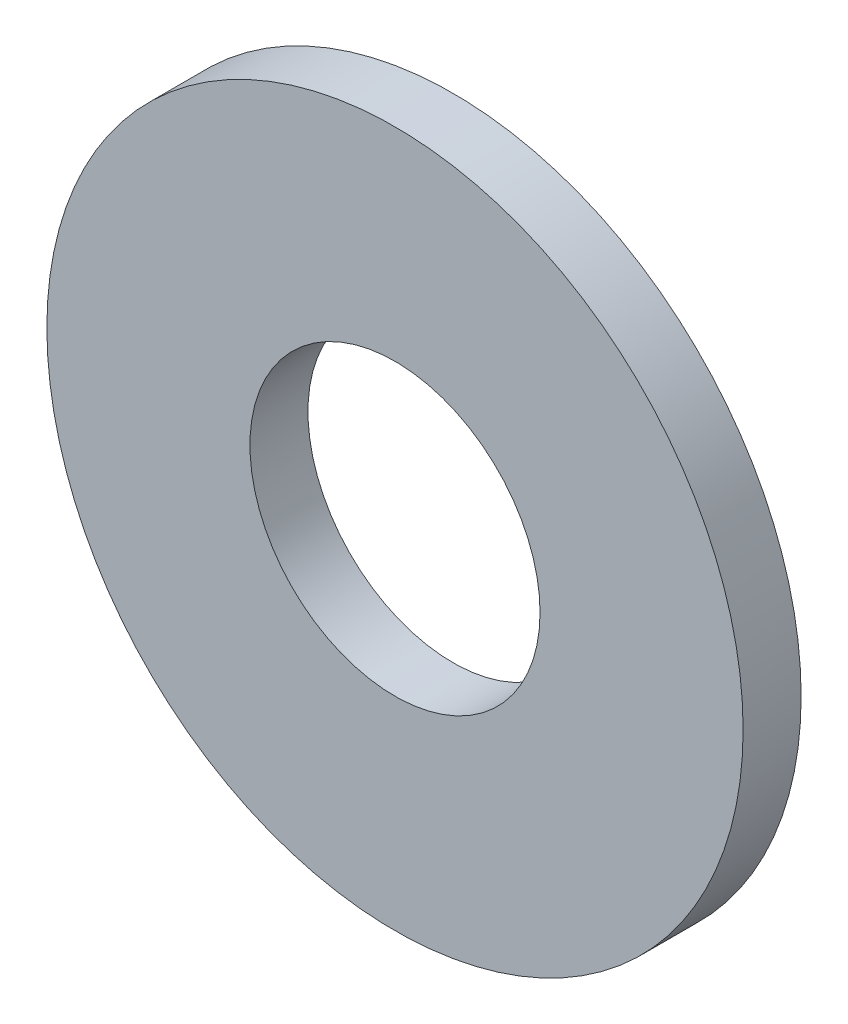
ISO-10303-21;
HEADER;
FILE_DESCRIPTION(('STEP AP214'),'2;1');
FILE_NAME('part.step','',(''),(''),'','','');
FILE_SCHEMA(('AUTOMOTIVE_DESIGN { 1 0 10303 214 1 1 1 1 }'));
ENDSEC;
DATA;
#1=APPLICATION_CONTEXT('core data for automotive mechanical design processes');
#2=APPLICATION_PROTOCOL_DEFINITION('international standard','automotive_design',2000,#1);
#3=PRODUCT_CONTEXT('',#1,'mechanical');
#4=PRODUCT('Part','Part','',(#3));
#5=PRODUCT_RELATED_PRODUCT_CATEGORY('part','',(#4));
#6=PRODUCT_DEFINITION_FORMATION('','',#4);
#7=PRODUCT_DEFINITION_CONTEXT('part definition',#1,'design');
#8=PRODUCT_DEFINITION('design','',#6,#7);
#9=PRODUCT_DEFINITION_SHAPE('','',#8);
#10=(LENGTH_UNIT() NAMED_UNIT(*) SI_UNIT(.MILLI.,.METRE.));
#11=(NAMED_UNIT(*) PLANE_ANGLE_UNIT() SI_UNIT($,.RADIAN.));
#12=(NAMED_UNIT(*) SI_UNIT($,.STERADIAN.) SOLID_ANGLE_UNIT());
#13=UNCERTAINTY_MEASURE_WITH_UNIT(LENGTH_MEASURE(1.E-05),#10,'distance_accuracy_value','');
#14=(GEOMETRIC_REPRESENTATION_CONTEXT(3) GLOBAL_UNCERTAINTY_ASSIGNED_CONTEXT((#13)) GLOBAL_UNIT_ASSIGNED_CONTEXT((#10,
#11,#12)) REPRESENTATION_CONTEXT('',''));
#15=CARTESIAN_POINT('',(0.,0.,0.));
#16=DIRECTION('',(0.,0.,1.));
#17=DIRECTION('',(1.,0.,0.));
#18=AXIS2_PLACEMENT_3D('',#15,#16,#17);
#19=CARTESIAN_POINT('',(-425.1,65.,58.));
#20=DIRECTION('',(0.,0.,1.));
#21=DIRECTION('',(1.,0.,0.));
#22=AXIS2_PLACEMENT_3D('',#19,#20,#21);
#23=PLANE('',#22);
#24=CARTESIAN_POINT('',(-425.1,65.,58.));
#25=DIRECTION('',(0.,0.,1.));
#26=DIRECTION('',(1.,0.,0.));
#27=AXIS2_PLACEMENT_3D('',#24,#25,#26);
#28=CIRCLE('',#27,5.);
#29=CARTESIAN_POINT('',(-420.1,65.,58.));
#30=VERTEX_POINT('',#29);
#31=EDGE_CURVE('E58',#30,#30,#28,.T.);
#32=ORIENTED_EDGE('',*,*,#31,.T.);
#33=EDGE_LOOP('',(#32));
#34=FACE_BOUND('',#33,.T.);
#35=CARTESIAN_POINT('',(-425.1,65.,58.));
#36=DIRECTION('',(0.,0.,1.));
#37=DIRECTION('',(1.,0.,0.));
#38=AXIS2_PLACEMENT_3D('',#35,#36,#37);
#39=CIRCLE('',#38,12.);
#40=CARTESIAN_POINT('',(-413.1,65.,58.));
#41=VERTEX_POINT('',#40);
#42=EDGE_CURVE('E50',#41,#41,#39,.T.);
#43=ORIENTED_EDGE('',*,*,#42,.F.);
#44=EDGE_LOOP('',(#43));
#45=FACE_BOUND('',#44,.T.);
#46=ADVANCED_FACE('F44',(#34,#45),#23,.F.);
#47=CARTESIAN_POINT('',(-425.1,65.,60.));
#48=DIRECTION('',(0.,0.,1.));
#49=DIRECTION('',(1.,0.,0.));
#50=AXIS2_PLACEMENT_3D('',#47,#48,#49);
#51=PLANE('',#50);
#52=CARTESIAN_POINT('',(-425.1,65.,60.));
#53=DIRECTION('',(0.,0.,1.));
#54=DIRECTION('',(1.,0.,0.));
#55=AXIS2_PLACEMENT_3D('',#52,#53,#54);
#56=CIRCLE('',#55,5.);
#57=CARTESIAN_POINT('',(-420.1,65.,60.));
#58=VERTEX_POINT('',#57);
#59=EDGE_CURVE('E54',#58,#58,#56,.T.);
#60=ORIENTED_EDGE('',*,*,#59,.F.);
#61=EDGE_LOOP('',(#60));
#62=FACE_BOUND('',#61,.T.);
#63=CARTESIAN_POINT('',(-425.1,65.,60.));
#64=DIRECTION('',(0.,0.,1.));
#65=DIRECTION('',(1.,0.,0.));
#66=AXIS2_PLACEMENT_3D('',#63,#64,#65);
#67=CIRCLE('',#66,12.);
#68=CARTESIAN_POINT('',(-413.1,65.,60.));
#69=VERTEX_POINT('',#68);
#70=EDGE_CURVE('E11',#69,#69,#67,.T.);
#71=ORIENTED_EDGE('',*,*,#70,.T.);
#72=EDGE_LOOP('',(#71));
#73=FACE_BOUND('',#72,.T.);
#74=ADVANCED_FACE('F74',(#62,#73),#51,.T.);
#75=CARTESIAN_POINT('',(-425.1,65.,58.));
#76=DIRECTION('',(0.,0.,1.));
#77=DIRECTION('',(1.,0.,0.));
#78=AXIS2_PLACEMENT_3D('',#75,#76,#77);
#79=CYLINDRICAL_SURFACE('',#78,12.);
#80=ORIENTED_EDGE('',*,*,#70,.F.);
#81=EDGE_LOOP('',(#80));
#82=FACE_BOUND('',#81,.T.);
#83=ORIENTED_EDGE('',*,*,#42,.T.);
#84=EDGE_LOOP('',(#83));
#85=FACE_BOUND('',#84,.T.);
#86=ADVANCED_FACE('F68',(#82,#85),#79,.T.);
#87=CARTESIAN_POINT('',(-425.1,65.,58.));
#88=DIRECTION('',(0.,0.,1.));
#89=DIRECTION('',(1.,0.,0.));
#90=AXIS2_PLACEMENT_3D('',#87,#88,#89);
#91=CYLINDRICAL_SURFACE('',#90,5.);
#92=ORIENTED_EDGE('',*,*,#59,.T.);
#93=EDGE_LOOP('',(#92));
#94=FACE_BOUND('',#93,.T.);
#95=ORIENTED_EDGE('',*,*,#31,.F.);
#96=EDGE_LOOP('',(#95));
#97=FACE_BOUND('',#96,.T.);
#98=ADVANCED_FACE('F66',(#94,#97),#91,.F.);
#99=CLOSED_SHELL('',(#46,#74,#86,#98));
#100=MANIFOLD_SOLID_BREP('B2',#99);
#101=ADVANCED_BREP_SHAPE_REPRESENTATION('',(#18,#100),#14);
#102=SHAPE_DEFINITION_REPRESENTATION(#9,#101);
ENDSEC;
END-ISO-10303-21;
